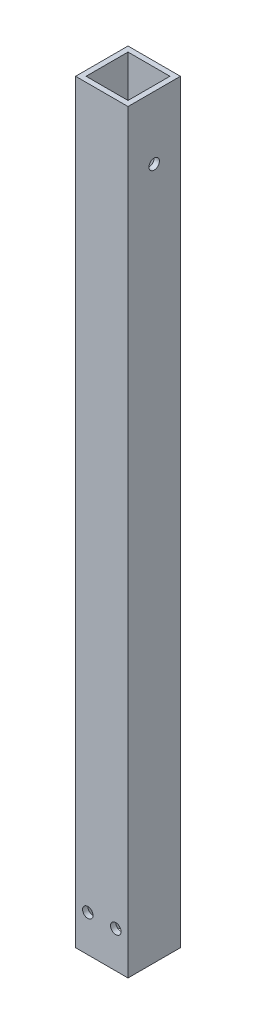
ISO-10303-21;
HEADER;
FILE_DESCRIPTION(('STEP AP214'),'2;1');
FILE_NAME('part.step','',(''),(''),'','','');
FILE_SCHEMA(('AUTOMOTIVE_DESIGN { 1 0 10303 214 1 1 1 1 }'));
ENDSEC;
DATA;
#1=APPLICATION_CONTEXT('core data for automotive mechanical design processes');
#2=APPLICATION_PROTOCOL_DEFINITION('international standard','automotive_design',2000,#1);
#3=PRODUCT_CONTEXT('',#1,'mechanical');
#4=PRODUCT('Part','Part','',(#3));
#5=PRODUCT_RELATED_PRODUCT_CATEGORY('part','',(#4));
#6=PRODUCT_DEFINITION_FORMATION('','',#4);
#7=PRODUCT_DEFINITION_CONTEXT('part definition',#1,'design');
#8=PRODUCT_DEFINITION('design','',#6,#7);
#9=PRODUCT_DEFINITION_SHAPE('','',#8);
#10=(LENGTH_UNIT() NAMED_UNIT(*) SI_UNIT(.MILLI.,.METRE.));
#11=(NAMED_UNIT(*) PLANE_ANGLE_UNIT() SI_UNIT($,.RADIAN.));
#12=(NAMED_UNIT(*) SI_UNIT($,.STERADIAN.) SOLID_ANGLE_UNIT());
#13=UNCERTAINTY_MEASURE_WITH_UNIT(LENGTH_MEASURE(1.E-05),#10,'distance_accuracy_value','');
#14=(GEOMETRIC_REPRESENTATION_CONTEXT(3) GLOBAL_UNCERTAINTY_ASSIGNED_CONTEXT((#13)) GLOBAL_UNIT_ASSIGNED_CONTEXT((#10,
#11,#12)) REPRESENTATION_CONTEXT('',''));
#15=CARTESIAN_POINT('',(0.,0.,0.));
#16=DIRECTION('',(0.,0.,1.));
#17=DIRECTION('',(1.,0.,0.));
#18=AXIS2_PLACEMENT_3D('',#15,#16,#17);
#19=CARTESIAN_POINT('',(0.,241.,0.));
#20=DIRECTION('',(0.,-1.,0.));
#21=DIRECTION('',(0.,0.,-1.));
#22=AXIS2_PLACEMENT_3D('',#19,#20,#21);
#23=PLANE('',#22);
#24=DIRECTION('',(0.,0.,-1.));
#25=VECTOR('',#24,1.);
#26=CARTESIAN_POINT('',(7.5,241.,7.5));
#27=LINE('',#26,#25);
#28=CARTESIAN_POINT('',(7.5,241.,7.5));
#29=VERTEX_POINT('',#28);
#30=CARTESIAN_POINT('',(7.5,241.,-7.5));
#31=VERTEX_POINT('',#30);
#32=EDGE_CURVE('E184',#29,#31,#27,.T.);
#33=ORIENTED_EDGE('',*,*,#32,.T.);
#34=DIRECTION('',(-1.,0.,0.));
#35=VECTOR('',#34,1.);
#36=CARTESIAN_POINT('',(-7.5,241.,-7.5));
#37=LINE('',#36,#35);
#38=CARTESIAN_POINT('',(-7.5,241.,-7.5));
#39=VERTEX_POINT('',#38);
#40=EDGE_CURVE('E119',#31,#39,#37,.T.);
#41=ORIENTED_EDGE('',*,*,#40,.T.);
#42=DIRECTION('',(0.,0.,1.));
#43=VECTOR('',#42,1.);
#44=CARTESIAN_POINT('',(-7.5,241.,7.5));
#45=LINE('',#44,#43);
#46=CARTESIAN_POINT('',(-7.5,241.,7.5));
#47=VERTEX_POINT('',#46);
#48=EDGE_CURVE('E187',#39,#47,#45,.T.);
#49=ORIENTED_EDGE('',*,*,#48,.T.);
#50=DIRECTION('',(1.,0.,0.));
#51=VECTOR('',#50,1.);
#52=CARTESIAN_POINT('',(-7.5,241.,7.5));
#53=LINE('',#52,#51);
#54=EDGE_CURVE('E189',#47,#29,#53,.T.);
#55=ORIENTED_EDGE('',*,*,#54,.T.);
#56=EDGE_LOOP('',(#33,#41,#49,#55));
#57=FACE_BOUND('',#56,.T.);
#58=DIRECTION('',(0.,0.,-1.));
#59=VECTOR('',#58,1.);
#60=CARTESIAN_POINT('',(6.,241.,6.));
#61=LINE('',#60,#59);
#62=CARTESIAN_POINT('',(6.,241.,6.));
#63=VERTEX_POINT('',#62);
#64=CARTESIAN_POINT('',(6.,241.,-6.));
#65=VERTEX_POINT('',#64);
#66=EDGE_CURVE('E163',#63,#65,#61,.T.);
#67=ORIENTED_EDGE('',*,*,#66,.F.);
#68=DIRECTION('',(1.,0.,0.));
#69=VECTOR('',#68,1.);
#70=CARTESIAN_POINT('',(-6.,241.,6.));
#71=LINE('',#70,#69);
#72=CARTESIAN_POINT('',(-6.,241.,6.));
#73=VERTEX_POINT('',#72);
#74=EDGE_CURVE('E170',#73,#63,#71,.T.);
#75=ORIENTED_EDGE('',*,*,#74,.F.);
#76=DIRECTION('',(0.,0.,1.));
#77=VECTOR('',#76,1.);
#78=CARTESIAN_POINT('',(-6.,241.,6.));
#79=LINE('',#78,#77);
#80=CARTESIAN_POINT('',(-6.,241.,-6.));
#81=VERTEX_POINT('',#80);
#82=EDGE_CURVE('E167',#81,#73,#79,.T.);
#83=ORIENTED_EDGE('',*,*,#82,.F.);
#84=DIRECTION('',(-1.,0.,0.));
#85=VECTOR('',#84,1.);
#86=CARTESIAN_POINT('',(-6.,241.,-6.));
#87=LINE('',#86,#85);
#88=EDGE_CURVE('E165',#65,#81,#87,.T.);
#89=ORIENTED_EDGE('',*,*,#88,.F.);
#90=EDGE_LOOP('',(#67,#75,#83,#89));
#91=FACE_BOUND('',#90,.T.);
#92=ADVANCED_FACE('F37',(#57,#91),#23,.F.);
#93=CARTESIAN_POINT('',(7.5,241.,7.5));
#94=DIRECTION('',(-1.,0.,0.));
#95=DIRECTION('',(0.,0.,1.));
#96=AXIS2_PLACEMENT_3D('',#93,#94,#95);
#97=PLANE('',#96);
#98=CARTESIAN_POINT('',(7.5,223.,0.));
#99=DIRECTION('',(1.,0.,0.));
#100=DIRECTION('',(0.,0.,-1.));
#101=AXIS2_PLACEMENT_3D('',#98,#99,#100);
#102=CIRCLE('',#101,1.5);
#103=CARTESIAN_POINT('',(7.5,223.,-1.5));
#104=VERTEX_POINT('',#103);
#105=EDGE_CURVE('E156',#104,#104,#102,.T.);
#106=ORIENTED_EDGE('',*,*,#105,.F.);
#107=EDGE_LOOP('',(#106));
#108=FACE_BOUND('',#107,.T.);
#109=DIRECTION('',(0.,-1.,0.));
#110=VECTOR('',#109,1.);
#111=CARTESIAN_POINT('',(7.5,241.,7.5));
#112=LINE('',#111,#110);
#113=CARTESIAN_POINT('',(7.5,25.,7.5));
#114=VERTEX_POINT('',#113);
#115=EDGE_CURVE('E116',#29,#114,#112,.T.);
#116=ORIENTED_EDGE('',*,*,#115,.T.);
#117=DIRECTION('',(0.,0.,-1.));
#118=VECTOR('',#117,1.);
#119=CARTESIAN_POINT('',(7.5,25.,-7.5));
#120=LINE('',#119,#118);
#121=CARTESIAN_POINT('',(7.5,25.,-7.5));
#122=VERTEX_POINT('',#121);
#123=EDGE_CURVE('E54',#114,#122,#120,.T.);
#124=ORIENTED_EDGE('',*,*,#123,.T.);
#125=DIRECTION('',(0.,-1.,0.));
#126=VECTOR('',#125,1.);
#127=CARTESIAN_POINT('',(7.5,241.,-7.5));
#128=LINE('',#127,#126);
#129=EDGE_CURVE('E46',#31,#122,#128,.T.);
#130=ORIENTED_EDGE('',*,*,#129,.F.);
#131=ORIENTED_EDGE('',*,*,#32,.F.);
#132=EDGE_LOOP('',(#116,#124,#130,#131));
#133=FACE_BOUND('',#132,.T.);
#134=ADVANCED_FACE('F39',(#108,#133),#97,.F.);
#135=CARTESIAN_POINT('',(-7.5,241.,-7.5));
#136=DIRECTION('',(0.,0.,1.));
#137=DIRECTION('',(1.,0.,0.));
#138=AXIS2_PLACEMENT_3D('',#135,#136,#137);
#139=PLANE('',#138);
#140=CARTESIAN_POINT('',(4.,35.5,-7.5));
#141=DIRECTION('',(0.,0.,1.));
#142=DIRECTION('',(1.,0.,0.));
#143=AXIS2_PLACEMENT_3D('',#140,#141,#142);
#144=CIRCLE('',#143,1.5);
#145=CARTESIAN_POINT('',(5.49999999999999,35.5,-7.5));
#146=VERTEX_POINT('',#145);
#147=EDGE_CURVE('E256',#146,#146,#144,.T.);
#148=ORIENTED_EDGE('',*,*,#147,.T.);
#149=EDGE_LOOP('',(#148));
#150=FACE_BOUND('',#149,.T.);
#151=CARTESIAN_POINT('',(-4.,35.5,-7.5));
#152=DIRECTION('',(0.,0.,1.));
#153=DIRECTION('',(1.,0.,0.));
#154=AXIS2_PLACEMENT_3D('',#151,#152,#153);
#155=CIRCLE('',#154,1.5);
#156=CARTESIAN_POINT('',(-2.50000000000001,35.5,-7.5));
#157=VERTEX_POINT('',#156);
#158=EDGE_CURVE('E134',#157,#157,#155,.T.);
#159=ORIENTED_EDGE('',*,*,#158,.T.);
#160=EDGE_LOOP('',(#159));
#161=FACE_BOUND('',#160,.T.);
#162=ORIENTED_EDGE('',*,*,#129,.T.);
#163=DIRECTION('',(-1.,0.,0.));
#164=VECTOR('',#163,1.);
#165=CARTESIAN_POINT('',(7.5,25.,-7.5));
#166=LINE('',#165,#164);
#167=CARTESIAN_POINT('',(-7.5,25.,-7.5));
#168=VERTEX_POINT('',#167);
#169=EDGE_CURVE('E101',#122,#168,#166,.T.);
#170=ORIENTED_EDGE('',*,*,#169,.T.);
#171=DIRECTION('',(0.,-1.,0.));
#172=VECTOR('',#171,1.);
#173=CARTESIAN_POINT('',(-7.5,241.,-7.5));
#174=LINE('',#173,#172);
#175=EDGE_CURVE('E121',#39,#168,#174,.T.);
#176=ORIENTED_EDGE('',*,*,#175,.F.);
#177=ORIENTED_EDGE('',*,*,#40,.F.);
#178=EDGE_LOOP('',(#162,#170,#176,#177));
#179=FACE_BOUND('',#178,.T.);
#180=ADVANCED_FACE('F118',(#150,#161,#179),#139,.F.);
#181=CARTESIAN_POINT('',(-7.5,241.,7.5));
#182=DIRECTION('',(1.,0.,0.));
#183=DIRECTION('',(0.,0.,-1.));
#184=AXIS2_PLACEMENT_3D('',#181,#182,#183);
#185=PLANE('',#184);
#186=CARTESIAN_POINT('',(-7.5,223.,0.));
#187=DIRECTION('',(1.,0.,0.));
#188=DIRECTION('',(0.,0.,-1.));
#189=AXIS2_PLACEMENT_3D('',#186,#187,#188);
#190=CIRCLE('',#189,1.5);
#191=CARTESIAN_POINT('',(-7.5,223.,-1.5));
#192=VERTEX_POINT('',#191);
#193=EDGE_CURVE('E130',#192,#192,#190,.F.);
#194=ORIENTED_EDGE('',*,*,#193,.F.);
#195=EDGE_LOOP('',(#194));
#196=FACE_BOUND('',#195,.T.);
#197=ORIENTED_EDGE('',*,*,#175,.T.);
#198=DIRECTION('',(0.,0.,-1.));
#199=VECTOR('',#198,1.);
#200=CARTESIAN_POINT('',(-7.5,25.,-7.5));
#201=LINE('',#200,#199);
#202=CARTESIAN_POINT('',(-7.5,25.,7.49999999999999));
#203=VERTEX_POINT('',#202);
#204=EDGE_CURVE('E104',#203,#168,#201,.T.);
#205=ORIENTED_EDGE('',*,*,#204,.F.);
#206=DIRECTION('',(0.,-1.,0.));
#207=VECTOR('',#206,1.);
#208=CARTESIAN_POINT('',(-7.5,241.,7.5));
#209=LINE('',#208,#207);
#210=EDGE_CURVE('E123',#47,#203,#209,.T.);
#211=ORIENTED_EDGE('',*,*,#210,.F.);
#212=ORIENTED_EDGE('',*,*,#48,.F.);
#213=EDGE_LOOP('',(#197,#205,#211,#212));
#214=FACE_BOUND('',#213,.T.);
#215=ADVANCED_FACE('F198',(#196,#214),#185,.F.);
#216=CARTESIAN_POINT('',(-7.5,241.,7.5));
#217=DIRECTION('',(0.,0.,-1.));
#218=DIRECTION('',(-1.,0.,0.));
#219=AXIS2_PLACEMENT_3D('',#216,#217,#218);
#220=PLANE('',#219);
#221=CARTESIAN_POINT('',(4.,35.5,7.5));
#222=DIRECTION('',(0.,0.,1.));
#223=DIRECTION('',(1.,0.,0.));
#224=AXIS2_PLACEMENT_3D('',#221,#222,#223);
#225=CIRCLE('',#224,1.5);
#226=CARTESIAN_POINT('',(5.49999999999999,35.5,7.5));
#227=VERTEX_POINT('',#226);
#228=EDGE_CURVE('E258',#227,#227,#225,.T.);
#229=ORIENTED_EDGE('',*,*,#228,.F.);
#230=EDGE_LOOP('',(#229));
#231=FACE_BOUND('',#230,.T.);
#232=CARTESIAN_POINT('',(-4.,35.5,7.5));
#233=DIRECTION('',(0.,0.,1.));
#234=DIRECTION('',(1.,0.,0.));
#235=AXIS2_PLACEMENT_3D('',#232,#233,#234);
#236=CIRCLE('',#235,1.5);
#237=CARTESIAN_POINT('',(-2.50000000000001,35.5,7.5));
#238=VERTEX_POINT('',#237);
#239=EDGE_CURVE('E140',#238,#238,#236,.T.);
#240=ORIENTED_EDGE('',*,*,#239,.F.);
#241=EDGE_LOOP('',(#240));
#242=FACE_BOUND('',#241,.T.);
#243=ORIENTED_EDGE('',*,*,#210,.T.);
#244=DIRECTION('',(-1.,0.,0.));
#245=VECTOR('',#244,1.);
#246=CARTESIAN_POINT('',(7.5,25.,7.49999999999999));
#247=LINE('',#246,#245);
#248=EDGE_CURVE('E109',#114,#203,#247,.T.);
#249=ORIENTED_EDGE('',*,*,#248,.F.);
#250=ORIENTED_EDGE('',*,*,#115,.F.);
#251=ORIENTED_EDGE('',*,*,#54,.F.);
#252=EDGE_LOOP('',(#243,#249,#250,#251));
#253=FACE_BOUND('',#252,.T.);
#254=ADVANCED_FACE('F195',(#231,#242,#253),#220,.F.);
#255=CARTESIAN_POINT('',(6.,241.,6.));
#256=DIRECTION('',(-1.,0.,0.));
#257=DIRECTION('',(0.,0.,1.));
#258=AXIS2_PLACEMENT_3D('',#255,#256,#257);
#259=PLANE('',#258);
#260=DIRECTION('',(0.,0.,-1.));
#261=VECTOR('',#260,1.);
#262=CARTESIAN_POINT('',(6.,25.,5.9999999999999));
#263=LINE('',#262,#261);
#264=CARTESIAN_POINT('',(6.,25.,6.));
#265=VERTEX_POINT('',#264);
#266=CARTESIAN_POINT('',(6.,25.,-6.));
#267=VERTEX_POINT('',#266);
#268=EDGE_CURVE('E154',#265,#267,#263,.T.);
#269=ORIENTED_EDGE('',*,*,#268,.F.);
#270=DIRECTION('',(0.,-1.,0.));
#271=VECTOR('',#270,1.);
#272=CARTESIAN_POINT('',(6.,241.,6.));
#273=LINE('',#272,#271);
#274=EDGE_CURVE('E172',#63,#265,#273,.T.);
#275=ORIENTED_EDGE('',*,*,#274,.F.);
#276=ORIENTED_EDGE('',*,*,#66,.T.);
#277=DIRECTION('',(0.,-1.,0.));
#278=VECTOR('',#277,1.);
#279=CARTESIAN_POINT('',(6.,241.,-6.));
#280=LINE('',#279,#278);
#281=EDGE_CURVE('E181',#65,#267,#280,.T.);
#282=ORIENTED_EDGE('',*,*,#281,.T.);
#283=EDGE_LOOP('',(#269,#275,#276,#282));
#284=FACE_BOUND('',#283,.T.);
#285=CARTESIAN_POINT('',(6.,223.,0.));
#286=DIRECTION('',(-1.,0.,0.));
#287=DIRECTION('',(0.,0.,1.));
#288=AXIS2_PLACEMENT_3D('',#285,#286,#287);
#289=CIRCLE('',#288,1.5);
#290=CARTESIAN_POINT('',(6.,223.,1.5));
#291=VERTEX_POINT('',#290);
#292=EDGE_CURVE('E129',#291,#291,#289,.T.);
#293=ORIENTED_EDGE('',*,*,#292,.F.);
#294=EDGE_LOOP('',(#293));
#295=FACE_BOUND('',#294,.T.);
#296=ADVANCED_FACE('F211',(#284,#295),#259,.T.);
#297=CARTESIAN_POINT('',(-6.,241.,-6.));
#298=DIRECTION('',(0.,0.,1.));
#299=DIRECTION('',(1.,0.,0.));
#300=AXIS2_PLACEMENT_3D('',#297,#298,#299);
#301=PLANE('',#300);
#302=CARTESIAN_POINT('',(4.,35.5,-6.));
#303=DIRECTION('',(0.,0.,1.));
#304=DIRECTION('',(1.,0.,0.));
#305=AXIS2_PLACEMENT_3D('',#302,#303,#304);
#306=CIRCLE('',#305,1.5);
#307=CARTESIAN_POINT('',(5.49999999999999,35.5,-6.));
#308=VERTEX_POINT('',#307);
#309=EDGE_CURVE('E145',#308,#308,#306,.T.);
#310=ORIENTED_EDGE('',*,*,#309,.F.);
#311=EDGE_LOOP('',(#310));
#312=FACE_BOUND('',#311,.T.);
#313=CARTESIAN_POINT('',(-4.,35.5,-6.));
#314=DIRECTION('',(0.,0.,1.));
#315=DIRECTION('',(1.,0.,0.));
#316=AXIS2_PLACEMENT_3D('',#313,#314,#315);
#317=CIRCLE('',#316,1.5);
#318=CARTESIAN_POINT('',(-2.50000000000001,35.5,-6.));
#319=VERTEX_POINT('',#318);
#320=EDGE_CURVE('E133',#319,#319,#317,.T.);
#321=ORIENTED_EDGE('',*,*,#320,.F.);
#322=EDGE_LOOP('',(#321));
#323=FACE_BOUND('',#322,.T.);
#324=DIRECTION('',(-1.,0.,0.));
#325=VECTOR('',#324,1.);
#326=CARTESIAN_POINT('',(-6.,25.,-6.));
#327=LINE('',#326,#325);
#328=CARTESIAN_POINT('',(-6.,25.,-6.));
#329=VERTEX_POINT('',#328);
#330=EDGE_CURVE('E152',#267,#329,#327,.T.);
#331=ORIENTED_EDGE('',*,*,#330,.F.);
#332=ORIENTED_EDGE('',*,*,#281,.F.);
#333=ORIENTED_EDGE('',*,*,#88,.T.);
#334=DIRECTION('',(0.,-1.,0.));
#335=VECTOR('',#334,1.);
#336=CARTESIAN_POINT('',(-6.,241.,-6.));
#337=LINE('',#336,#335);
#338=EDGE_CURVE('E178',#81,#329,#337,.T.);
#339=ORIENTED_EDGE('',*,*,#338,.T.);
#340=EDGE_LOOP('',(#331,#332,#333,#339));
#341=FACE_BOUND('',#340,.T.);
#342=ADVANCED_FACE('F215',(#312,#323,#341),#301,.T.);
#343=CARTESIAN_POINT('',(-6.,241.,6.));
#344=DIRECTION('',(1.,0.,0.));
#345=DIRECTION('',(0.,0.,-1.));
#346=AXIS2_PLACEMENT_3D('',#343,#344,#345);
#347=PLANE('',#346);
#348=DIRECTION('',(0.,0.,1.));
#349=VECTOR('',#348,1.);
#350=CARTESIAN_POINT('',(-6.,25.,5.9999999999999));
#351=LINE('',#350,#349);
#352=CARTESIAN_POINT('',(-6.,25.,6.));
#353=VERTEX_POINT('',#352);
#354=EDGE_CURVE('E61',#329,#353,#351,.T.);
#355=ORIENTED_EDGE('',*,*,#354,.F.);
#356=ORIENTED_EDGE('',*,*,#338,.F.);
#357=ORIENTED_EDGE('',*,*,#82,.T.);
#358=DIRECTION('',(0.,-1.,0.));
#359=VECTOR('',#358,1.);
#360=CARTESIAN_POINT('',(-6.,241.,6.));
#361=LINE('',#360,#359);
#362=EDGE_CURVE('E175',#73,#353,#361,.T.);
#363=ORIENTED_EDGE('',*,*,#362,.T.);
#364=EDGE_LOOP('',(#355,#356,#357,#363));
#365=FACE_BOUND('',#364,.T.);
#366=CARTESIAN_POINT('',(-6.,223.,0.));
#367=DIRECTION('',(1.,0.,0.));
#368=DIRECTION('',(0.,0.,-1.));
#369=AXIS2_PLACEMENT_3D('',#366,#367,#368);
#370=CIRCLE('',#369,1.5);
#371=CARTESIAN_POINT('',(-6.,223.,-1.5));
#372=VERTEX_POINT('',#371);
#373=EDGE_CURVE('E127',#372,#372,#370,.T.);
#374=ORIENTED_EDGE('',*,*,#373,.F.);
#375=EDGE_LOOP('',(#374));
#376=FACE_BOUND('',#375,.T.);
#377=ADVANCED_FACE('F218',(#365,#376),#347,.T.);
#378=CARTESIAN_POINT('',(-6.,241.,6.));
#379=DIRECTION('',(0.,0.,-1.));
#380=DIRECTION('',(-1.,0.,0.));
#381=AXIS2_PLACEMENT_3D('',#378,#379,#380);
#382=PLANE('',#381);
#383=CARTESIAN_POINT('',(4.,35.5,6.));
#384=DIRECTION('',(0.,0.,-1.));
#385=DIRECTION('',(-1.,0.,0.));
#386=AXIS2_PLACEMENT_3D('',#383,#384,#385);
#387=CIRCLE('',#386,1.5);
#388=CARTESIAN_POINT('',(2.5,35.5,6.));
#389=VERTEX_POINT('',#388);
#390=EDGE_CURVE('E41',#389,#389,#387,.T.);
#391=ORIENTED_EDGE('',*,*,#390,.F.);
#392=EDGE_LOOP('',(#391));
#393=FACE_BOUND('',#392,.T.);
#394=CARTESIAN_POINT('',(-4.,35.5,6.));
#395=DIRECTION('',(0.,0.,-1.));
#396=DIRECTION('',(-1.,0.,0.));
#397=AXIS2_PLACEMENT_3D('',#394,#395,#396);
#398=CIRCLE('',#397,1.5);
#399=CARTESIAN_POINT('',(-5.5,35.5,6.));
#400=VERTEX_POINT('',#399);
#401=EDGE_CURVE('E131',#400,#400,#398,.T.);
#402=ORIENTED_EDGE('',*,*,#401,.F.);
#403=EDGE_LOOP('',(#402));
#404=FACE_BOUND('',#403,.T.);
#405=DIRECTION('',(1.,0.,0.));
#406=VECTOR('',#405,1.);
#407=CARTESIAN_POINT('',(-6.,25.,6.));
#408=LINE('',#407,#406);
#409=EDGE_CURVE('E11',#353,#265,#408,.T.);
#410=ORIENTED_EDGE('',*,*,#409,.F.);
#411=ORIENTED_EDGE('',*,*,#362,.F.);
#412=ORIENTED_EDGE('',*,*,#74,.T.);
#413=ORIENTED_EDGE('',*,*,#274,.T.);
#414=EDGE_LOOP('',(#410,#411,#412,#413));
#415=FACE_BOUND('',#414,.T.);
#416=ADVANCED_FACE('F221',(#393,#404,#415),#382,.T.);
#417=CARTESIAN_POINT('',(-11.7426406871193,223.,0.));
#418=DIRECTION('',(1.,0.,0.));
#419=DIRECTION('',(0.,0.,-1.));
#420=AXIS2_PLACEMENT_3D('',#417,#418,#419);
#421=CYLINDRICAL_SURFACE('',#420,1.5);
#422=ORIENTED_EDGE('',*,*,#373,.T.);
#423=EDGE_LOOP('',(#422));
#424=FACE_BOUND('',#423,.T.);
#425=ORIENTED_EDGE('',*,*,#193,.T.);
#426=EDGE_LOOP('',(#425));
#427=FACE_BOUND('',#426,.T.);
#428=ADVANCED_FACE('F223',(#424,#427),#421,.F.);
#429=ORIENTED_EDGE('',*,*,#292,.T.);
#430=EDGE_LOOP('',(#429));
#431=FACE_BOUND('',#430,.T.);
#432=ORIENTED_EDGE('',*,*,#105,.T.);
#433=EDGE_LOOP('',(#432));
#434=FACE_BOUND('',#433,.T.);
#435=ADVANCED_FACE('F230',(#431,#434),#421,.F.);
#436=CARTESIAN_POINT('',(7.5,25.,-7.5));
#437=DIRECTION('',(0.,1.,0.));
#438=DIRECTION('',(0.,0.,1.));
#439=AXIS2_PLACEMENT_3D('',#436,#437,#438);
#440=PLANE('',#439);
#441=ORIENTED_EDGE('',*,*,#268,.T.);
#442=ORIENTED_EDGE('',*,*,#330,.T.);
#443=ORIENTED_EDGE('',*,*,#354,.T.);
#444=ORIENTED_EDGE('',*,*,#409,.T.);
#445=EDGE_LOOP('',(#441,#442,#443,#444));
#446=FACE_BOUND('',#445,.T.);
#447=ORIENTED_EDGE('',*,*,#204,.T.);
#448=ORIENTED_EDGE('',*,*,#169,.F.);
#449=ORIENTED_EDGE('',*,*,#123,.F.);
#450=ORIENTED_EDGE('',*,*,#248,.T.);
#451=EDGE_LOOP('',(#447,#448,#449,#450));
#452=FACE_BOUND('',#451,.T.);
#453=ADVANCED_FACE('F102',(#446,#452),#440,.F.);
#454=CARTESIAN_POINT('',(-4.,35.5,7.5));
#455=DIRECTION('',(0.,0.,1.));
#456=DIRECTION('',(1.,0.,0.));
#457=AXIS2_PLACEMENT_3D('',#454,#455,#456);
#458=CYLINDRICAL_SURFACE('',#457,1.5);
#459=ORIENTED_EDGE('',*,*,#401,.T.);
#460=EDGE_LOOP('',(#459));
#461=FACE_BOUND('',#460,.T.);
#462=ORIENTED_EDGE('',*,*,#239,.T.);
#463=EDGE_LOOP('',(#462));
#464=FACE_BOUND('',#463,.T.);
#465=ADVANCED_FACE('F274',(#461,#464),#458,.F.);
#466=ORIENTED_EDGE('',*,*,#320,.T.);
#467=EDGE_LOOP('',(#466));
#468=FACE_BOUND('',#467,.T.);
#469=ORIENTED_EDGE('',*,*,#158,.F.);
#470=EDGE_LOOP('',(#469));
#471=FACE_BOUND('',#470,.T.);
#472=ADVANCED_FACE('F270',(#468,#471),#458,.F.);
#473=CARTESIAN_POINT('',(4.,35.5,7.5));
#474=DIRECTION('',(0.,0.,1.));
#475=DIRECTION('',(1.,0.,0.));
#476=AXIS2_PLACEMENT_3D('',#473,#474,#475);
#477=CYLINDRICAL_SURFACE('',#476,1.5);
#478=ORIENTED_EDGE('',*,*,#390,.T.);
#479=EDGE_LOOP('',(#478));
#480=FACE_BOUND('',#479,.T.);
#481=ORIENTED_EDGE('',*,*,#228,.T.);
#482=EDGE_LOOP('',(#481));
#483=FACE_BOUND('',#482,.T.);
#484=ADVANCED_FACE('F273',(#480,#483),#477,.F.);
#485=ORIENTED_EDGE('',*,*,#309,.T.);
#486=EDGE_LOOP('',(#485));
#487=FACE_BOUND('',#486,.T.);
#488=ORIENTED_EDGE('',*,*,#147,.F.);
#489=EDGE_LOOP('',(#488));
#490=FACE_BOUND('',#489,.T.);
#491=ADVANCED_FACE('F266',(#487,#490),#477,.F.);
#492=CLOSED_SHELL('',(#92,#134,#180,#215,#254,#296,#342,#377,#416,#428,#435,#453,#465,#472,#484,#491));
#493=MANIFOLD_SOLID_BREP('B2',#492);
#494=ADVANCED_BREP_SHAPE_REPRESENTATION('',(#18,#493),#14);
#495=SHAPE_DEFINITION_REPRESENTATION(#9,#494);
ENDSEC;
END-ISO-10303-21;
